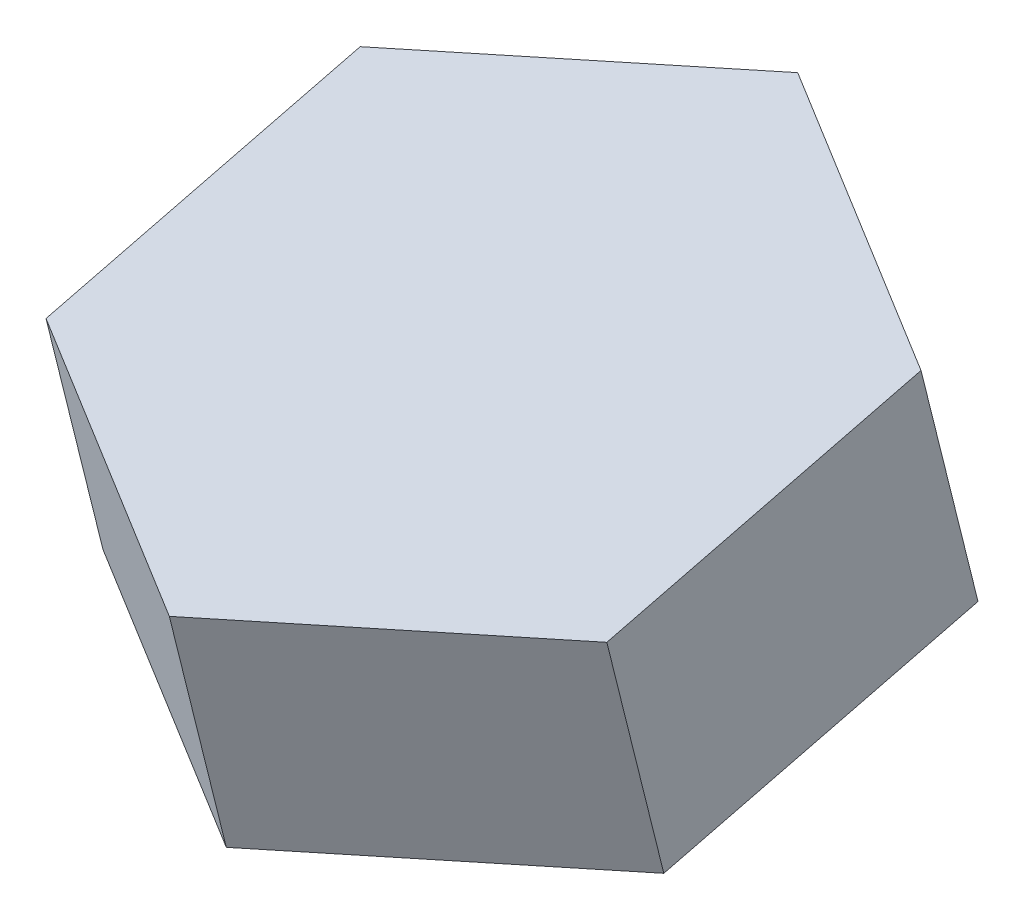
ISO-10303-21;
HEADER;
FILE_DESCRIPTION(('STEP AP214'),'2;1');
FILE_NAME('part.step','',(''),(''),'','','');
FILE_SCHEMA(('AUTOMOTIVE_DESIGN { 1 0 10303 214 1 1 1 1 }'));
ENDSEC;
DATA;
#1=APPLICATION_CONTEXT('core data for automotive mechanical design processes');
#2=APPLICATION_PROTOCOL_DEFINITION('international standard','automotive_design',2000,#1);
#3=PRODUCT_CONTEXT('',#1,'mechanical');
#4=PRODUCT('Part','Part','',(#3));
#5=PRODUCT_RELATED_PRODUCT_CATEGORY('part','',(#4));
#6=PRODUCT_DEFINITION_FORMATION('','',#4);
#7=PRODUCT_DEFINITION_CONTEXT('part definition',#1,'design');
#8=PRODUCT_DEFINITION('design','',#6,#7);
#9=PRODUCT_DEFINITION_SHAPE('','',#8);
#10=(LENGTH_UNIT() NAMED_UNIT(*) SI_UNIT(.MILLI.,.METRE.));
#11=(NAMED_UNIT(*) PLANE_ANGLE_UNIT() SI_UNIT($,.RADIAN.));
#12=(NAMED_UNIT(*) SI_UNIT($,.STERADIAN.) SOLID_ANGLE_UNIT());
#13=UNCERTAINTY_MEASURE_WITH_UNIT(LENGTH_MEASURE(1.E-05),#10,'distance_accuracy_value','');
#14=(GEOMETRIC_REPRESENTATION_CONTEXT(3) GLOBAL_UNCERTAINTY_ASSIGNED_CONTEXT((#13)) GLOBAL_UNIT_ASSIGNED_CONTEXT((#10,
#11,#12)) REPRESENTATION_CONTEXT('',''));
#15=CARTESIAN_POINT('',(0.,0.,0.));
#16=DIRECTION('',(0.,0.,1.));
#17=DIRECTION('',(1.,0.,0.));
#18=AXIS2_PLACEMENT_3D('',#15,#16,#17);
#19=CARTESIAN_POINT('',(-752.072223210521,-215.905643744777,-494.411753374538));
#20=DIRECTION('',(0.,-0.970295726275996,-0.241921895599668));
#21=DIRECTION('',(0.,0.241921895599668,-0.970295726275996));
#22=AXIS2_PLACEMENT_3D('',#19,#20,#21);
#23=PLANE('',#22);
#24=DIRECTION('',(-0.86602540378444,-0.120960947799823,0.485147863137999));
#25=VECTOR('',#24,1.);
#26=CARTESIAN_POINT('',(-739.372223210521,-215.905643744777,-494.411753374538));
#27=LINE('',#26,#25);
#28=CARTESIAN_POINT('',(-739.372223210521,-215.905643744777,-494.411753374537));
#29=VERTEX_POINT('',#28);
#30=CARTESIAN_POINT('',(-745.722223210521,-216.792571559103,-490.854480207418));
#31=VERTEX_POINT('',#30);
#32=EDGE_CURVE('E67',#29,#31,#27,.T.);
#33=ORIENTED_EDGE('',*,*,#32,.F.);
#34=DIRECTION('',(0.,-0.241921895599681,0.970295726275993));
#35=VECTOR('',#34,1.);
#36=CARTESIAN_POINT('',(-739.372223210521,-214.131788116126,-501.526299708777));
#37=LINE('',#36,#35);
#38=CARTESIAN_POINT('',(-739.372223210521,-214.131788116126,-501.526299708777));
#39=VERTEX_POINT('',#38);
#40=EDGE_CURVE('E20',#39,#29,#37,.T.);
#41=ORIENTED_EDGE('',*,*,#40,.F.);
#42=DIRECTION('',(0.866025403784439,-0.120960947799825,0.485147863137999));
#43=VECTOR('',#42,1.);
#44=CARTESIAN_POINT('',(-745.722223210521,-213.2448603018,-505.083572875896));
#45=LINE('',#44,#43);
#46=CARTESIAN_POINT('',(-745.722223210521,-213.2448603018,-505.083572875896));
#47=VERTEX_POINT('',#46);
#48=EDGE_CURVE('E103',#47,#39,#45,.T.);
#49=ORIENTED_EDGE('',*,*,#48,.F.);
#50=DIRECTION('',(0.866025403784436,0.12096094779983,-0.485147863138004));
#51=VECTOR('',#50,1.);
#52=CARTESIAN_POINT('',(-752.072223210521,-214.131788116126,-501.526299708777));
#53=LINE('',#52,#51);
#54=CARTESIAN_POINT('',(-752.072223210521,-214.131788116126,-501.526299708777));
#55=VERTEX_POINT('',#54);
#56=EDGE_CURVE('E100',#55,#47,#53,.T.);
#57=ORIENTED_EDGE('',*,*,#56,.F.);
#58=DIRECTION('',(0.,0.241921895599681,-0.970295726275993));
#59=VECTOR('',#58,1.);
#60=CARTESIAN_POINT('',(-752.072223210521,-215.905643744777,-494.411753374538));
#61=LINE('',#60,#59);
#62=CARTESIAN_POINT('',(-752.072223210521,-215.905643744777,-494.411753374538));
#63=VERTEX_POINT('',#62);
#64=EDGE_CURVE('E95',#63,#55,#61,.T.);
#65=ORIENTED_EDGE('',*,*,#64,.F.);
#66=DIRECTION('',(-0.86602540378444,0.120960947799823,-0.485147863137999));
#67=VECTOR('',#66,1.);
#68=CARTESIAN_POINT('',(-745.722223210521,-216.792571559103,-490.854480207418));
#69=LINE('',#68,#67);
#70=EDGE_CURVE('E81',#31,#63,#69,.T.);
#71=ORIENTED_EDGE('',*,*,#70,.F.);
#72=EDGE_LOOP('',(#33,#41,#49,#57,#65,#71));
#73=FACE_BOUND('',#72,.T.);
#74=ADVANCED_FACE('F17',(#73),#23,.F.);
#75=CARTESIAN_POINT('',(-739.372223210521,-219.307345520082,-502.816711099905));
#76=DIRECTION('',(1.,0.,0.));
#77=DIRECTION('',(0.,1.,0.));
#78=AXIS2_PLACEMENT_3D('',#75,#76,#77);
#79=PLANE('',#78);
#80=ORIENTED_EDGE('',*,*,#40,.T.);
#81=DIRECTION('',(0.,0.970295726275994,0.241921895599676));
#82=VECTOR('',#81,1.);
#83=CARTESIAN_POINT('',(-739.372223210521,-221.081201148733,-495.702164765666));
#84=LINE('',#83,#82);
#85=CARTESIAN_POINT('',(-739.372223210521,-221.081201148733,-495.702164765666));
#86=VERTEX_POINT('',#85);
#87=EDGE_CURVE('E73',#86,#29,#84,.T.);
#88=ORIENTED_EDGE('',*,*,#87,.F.);
#89=DIRECTION('',(0.,0.241921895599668,-0.970295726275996));
#90=VECTOR('',#89,1.);
#91=CARTESIAN_POINT('',(-739.372223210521,-220.194273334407,-499.259437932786));
#92=LINE('',#91,#90);
#93=CARTESIAN_POINT('',(-739.372223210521,-219.307345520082,-502.816711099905));
#94=VERTEX_POINT('',#93);
#95=EDGE_CURVE('E106',#94,#86,#92,.F.);
#96=ORIENTED_EDGE('',*,*,#95,.F.);
#97=DIRECTION('',(0.,-0.970295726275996,-0.241921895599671));
#98=VECTOR('',#97,1.);
#99=CARTESIAN_POINT('',(-739.372223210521,-214.131788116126,-501.526299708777));
#100=LINE('',#99,#98);
#101=EDGE_CURVE('E76',#39,#94,#100,.T.);
#102=ORIENTED_EDGE('',*,*,#101,.F.);
#103=EDGE_LOOP('',(#80,#88,#96,#102));
#104=FACE_BOUND('',#103,.T.);
#105=ADVANCED_FACE('F72',(#104),#79,.T.);
#106=CARTESIAN_POINT('',(-739.372223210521,-221.081201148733,-495.702164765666));
#107=DIRECTION('',(0.5,-0.209510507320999,0.840300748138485));
#108=DIRECTION('',(0.859373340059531,0.,-0.511348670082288));
#109=AXIS2_PLACEMENT_3D('',#106,#107,#108);
#110=PLANE('',#109);
#111=ORIENTED_EDGE('',*,*,#32,.T.);
#112=DIRECTION('',(0.,0.970295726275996,0.241921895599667));
#113=VECTOR('',#112,1.);
#114=CARTESIAN_POINT('',(-745.722223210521,-221.968128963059,-492.144891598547));
#115=LINE('',#114,#113);
#116=CARTESIAN_POINT('',(-745.722223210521,-221.968128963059,-492.144891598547));
#117=VERTEX_POINT('',#116);
#118=EDGE_CURVE('E83',#117,#31,#115,.T.);
#119=ORIENTED_EDGE('',*,*,#118,.F.);
#120=DIRECTION('',(-0.866025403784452,-0.120960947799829,0.485147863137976));
#121=VECTOR('',#120,1.);
#122=CARTESIAN_POINT('',(-739.372223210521,-221.081201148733,-495.702164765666));
#123=LINE('',#122,#121);
#124=EDGE_CURVE('E87',#86,#117,#123,.T.);
#125=ORIENTED_EDGE('',*,*,#124,.F.);
#126=ORIENTED_EDGE('',*,*,#87,.T.);
#127=EDGE_LOOP('',(#111,#119,#125,#126));
#128=FACE_BOUND('',#127,.T.);
#129=ADVANCED_FACE('F85',(#128),#110,.T.);
#130=CARTESIAN_POINT('',(-745.722223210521,-221.968128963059,-492.144891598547));
#131=DIRECTION('',(-0.5,-0.209510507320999,0.840300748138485));
#132=DIRECTION('',(0.859373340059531,0.,0.511348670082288));
#133=AXIS2_PLACEMENT_3D('',#130,#131,#132);
#134=PLANE('',#133);
#135=ORIENTED_EDGE('',*,*,#70,.T.);
#136=DIRECTION('',(0.,0.970295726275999,0.241921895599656));
#137=VECTOR('',#136,1.);
#138=CARTESIAN_POINT('',(-752.072223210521,-221.081201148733,-495.702164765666));
#139=LINE('',#138,#137);
#140=CARTESIAN_POINT('',(-752.072223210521,-221.081201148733,-495.702164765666));
#141=VERTEX_POINT('',#140);
#142=EDGE_CURVE('E92',#141,#63,#139,.T.);
#143=ORIENTED_EDGE('',*,*,#142,.F.);
#144=DIRECTION('',(-0.866025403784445,0.120960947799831,-0.485147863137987));
#145=VECTOR('',#144,1.);
#146=CARTESIAN_POINT('',(-745.722223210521,-221.968128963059,-492.144891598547));
#147=LINE('',#146,#145);
#148=EDGE_CURVE('E109',#117,#141,#147,.T.);
#149=ORIENTED_EDGE('',*,*,#148,.F.);
#150=ORIENTED_EDGE('',*,*,#118,.T.);
#151=EDGE_LOOP('',(#135,#143,#149,#150));
#152=FACE_BOUND('',#151,.T.);
#153=ADVANCED_FACE('F137',(#152),#134,.T.);
#154=CARTESIAN_POINT('',(-752.072223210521,-221.081201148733,-495.702164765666));
#155=DIRECTION('',(-1.,0.,0.));
#156=DIRECTION('',(0.,-1.,0.));
#157=AXIS2_PLACEMENT_3D('',#154,#155,#156);
#158=PLANE('',#157);
#159=ORIENTED_EDGE('',*,*,#64,.T.);
#160=DIRECTION('',(0.,0.970295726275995,0.241921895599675));
#161=VECTOR('',#160,1.);
#162=CARTESIAN_POINT('',(-752.072223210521,-219.307345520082,-502.816711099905));
#163=LINE('',#162,#161);
#164=CARTESIAN_POINT('',(-752.072223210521,-219.307345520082,-502.816711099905));
#165=VERTEX_POINT('',#164);
#166=EDGE_CURVE('E97',#165,#55,#163,.T.);
#167=ORIENTED_EDGE('',*,*,#166,.F.);
#168=DIRECTION('',(0.,0.241921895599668,-0.970295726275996));
#169=VECTOR('',#168,1.);
#170=CARTESIAN_POINT('',(-752.072223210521,-220.194273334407,-499.259437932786));
#171=LINE('',#170,#169);
#172=EDGE_CURVE('E112',#141,#165,#171,.T.);
#173=ORIENTED_EDGE('',*,*,#172,.F.);
#174=ORIENTED_EDGE('',*,*,#142,.T.);
#175=EDGE_LOOP('',(#159,#167,#173,#174));
#176=FACE_BOUND('',#175,.T.);
#177=ADVANCED_FACE('F122',(#176),#158,.T.);
#178=CARTESIAN_POINT('',(-752.072223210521,-219.307345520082,-502.816711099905));
#179=DIRECTION('',(-0.499999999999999,0.209510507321,-0.840300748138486));
#180=DIRECTION('',(-0.859373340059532,0.,0.511348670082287));
#181=AXIS2_PLACEMENT_3D('',#178,#179,#180);
#182=PLANE('',#181);
#183=ORIENTED_EDGE('',*,*,#56,.T.);
#184=DIRECTION('',(0.,0.970295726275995,0.241921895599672));
#185=VECTOR('',#184,1.);
#186=CARTESIAN_POINT('',(-745.722223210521,-218.420417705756,-506.373984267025));
#187=LINE('',#186,#185);
#188=CARTESIAN_POINT('',(-745.722223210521,-218.420417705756,-506.373984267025));
#189=VERTEX_POINT('',#188);
#190=EDGE_CURVE('E35',#189,#47,#187,.T.);
#191=ORIENTED_EDGE('',*,*,#190,.F.);
#192=DIRECTION('',(0.866025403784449,0.120960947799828,-0.485147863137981));
#193=VECTOR('',#192,1.);
#194=CARTESIAN_POINT('',(-752.072223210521,-219.307345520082,-502.816711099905));
#195=LINE('',#194,#193);
#196=EDGE_CURVE('E26',#165,#189,#195,.T.);
#197=ORIENTED_EDGE('',*,*,#196,.F.);
#198=ORIENTED_EDGE('',*,*,#166,.T.);
#199=EDGE_LOOP('',(#183,#191,#197,#198));
#200=FACE_BOUND('',#199,.T.);
#201=ADVANCED_FACE('F119',(#200),#182,.T.);
#202=CARTESIAN_POINT('',(-745.722223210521,-218.420417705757,-506.373984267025));
#203=DIRECTION('',(0.500000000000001,0.209510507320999,-0.840300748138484));
#204=DIRECTION('',(-0.859373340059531,0.,-0.511348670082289));
#205=AXIS2_PLACEMENT_3D('',#202,#203,#204);
#206=PLANE('',#205);
#207=ORIENTED_EDGE('',*,*,#48,.T.);
#208=ORIENTED_EDGE('',*,*,#101,.T.);
#209=DIRECTION('',(0.866025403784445,-0.12096094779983,0.485147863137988));
#210=VECTOR('',#209,1.);
#211=CARTESIAN_POINT('',(-745.722223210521,-218.420417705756,-506.373984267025));
#212=LINE('',#211,#210);
#213=EDGE_CURVE('E11',#189,#94,#212,.T.);
#214=ORIENTED_EDGE('',*,*,#213,.F.);
#215=ORIENTED_EDGE('',*,*,#190,.T.);
#216=EDGE_LOOP('',(#207,#208,#214,#215));
#217=FACE_BOUND('',#216,.T.);
#218=ADVANCED_FACE('F124',(#217),#206,.T.);
#219=CARTESIAN_POINT('',(-745.722223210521,-220.194273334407,-499.259437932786));
#220=DIRECTION('',(0.,-0.970295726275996,-0.241921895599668));
#221=DIRECTION('',(0.,0.241921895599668,-0.970295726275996));
#222=AXIS2_PLACEMENT_3D('',#219,#220,#221);
#223=PLANE('',#222);
#224=ORIENTED_EDGE('',*,*,#196,.T.);
#225=ORIENTED_EDGE('',*,*,#213,.T.);
#226=ORIENTED_EDGE('',*,*,#95,.T.);
#227=ORIENTED_EDGE('',*,*,#124,.T.);
#228=ORIENTED_EDGE('',*,*,#148,.T.);
#229=ORIENTED_EDGE('',*,*,#172,.T.);
#230=EDGE_LOOP('',(#224,#225,#226,#227,#228,#229));
#231=FACE_BOUND('',#230,.T.);
#232=ADVANCED_FACE('F117',(#231),#223,.T.);
#233=CLOSED_SHELL('',(#74,#105,#129,#153,#177,#201,#218,#232));
#234=MANIFOLD_SOLID_BREP('B1',#233);
#235=ADVANCED_BREP_SHAPE_REPRESENTATION('',(#18,#234),#14);
#236=SHAPE_DEFINITION_REPRESENTATION(#9,#235);
ENDSEC;
END-ISO-10303-21;
